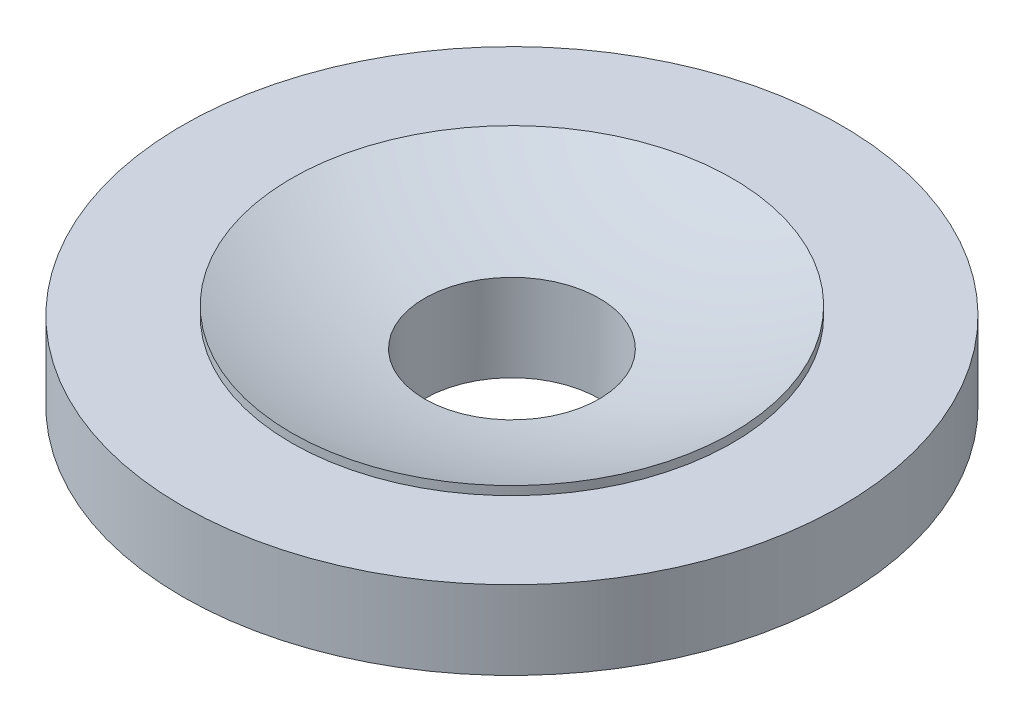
ISO-10303-21;
HEADER;
FILE_DESCRIPTION(('STEP AP214'),'2;1');
FILE_NAME('part.step','',(''),(''),'','','');
FILE_SCHEMA(('AUTOMOTIVE_DESIGN { 1 0 10303 214 1 1 1 1 }'));
ENDSEC;
DATA;
#1=APPLICATION_CONTEXT('core data for automotive mechanical design processes');
#2=APPLICATION_PROTOCOL_DEFINITION('international standard','automotive_design',2000,#1);
#3=PRODUCT_CONTEXT('',#1,'mechanical');
#4=PRODUCT('Part','Part','',(#3));
#5=PRODUCT_RELATED_PRODUCT_CATEGORY('part','',(#4));
#6=PRODUCT_DEFINITION_FORMATION('','',#4);
#7=PRODUCT_DEFINITION_CONTEXT('part definition',#1,'design');
#8=PRODUCT_DEFINITION('design','',#6,#7);
#9=PRODUCT_DEFINITION_SHAPE('','',#8);
#10=(LENGTH_UNIT() NAMED_UNIT(*) SI_UNIT(.MILLI.,.METRE.));
#11=(NAMED_UNIT(*) PLANE_ANGLE_UNIT() SI_UNIT($,.RADIAN.));
#12=(NAMED_UNIT(*) SI_UNIT($,.STERADIAN.) SOLID_ANGLE_UNIT());
#13=UNCERTAINTY_MEASURE_WITH_UNIT(LENGTH_MEASURE(1.E-05),#10,'distance_accuracy_value','');
#14=(GEOMETRIC_REPRESENTATION_CONTEXT(3) GLOBAL_UNCERTAINTY_ASSIGNED_CONTEXT((#13)) GLOBAL_UNIT_ASSIGNED_CONTEXT((#10,
#11,#12)) REPRESENTATION_CONTEXT('',''));
#15=CARTESIAN_POINT('',(0.,0.,0.));
#16=DIRECTION('',(0.,0.,1.));
#17=DIRECTION('',(1.,0.,0.));
#18=AXIS2_PLACEMENT_3D('',#15,#16,#17);
#19=CARTESIAN_POINT('',(0.,239.998094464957,0.));
#20=DIRECTION('',(0.,1.,0.));
#21=DIRECTION('',(0.,0.,1.));
#22=AXIS2_PLACEMENT_3D('',#19,#20,#21);
#23=DEGENERATE_TOROIDAL_SURFACE('',#22,0.995426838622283,260.,.T.);
#24=CARTESIAN_POINT('',(0.,-17.0595708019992,0.));
#25=DIRECTION('',(0.,1.,0.));
#26=DIRECTION('',(0.,0.,1.));
#27=AXIS2_PLACEMENT_3D('',#24,#25,#26);
#28=CIRCLE('',#27,40.);
#29=CARTESIAN_POINT('',(0.,-17.0595708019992,40.));
#30=VERTEX_POINT('',#29);
#31=EDGE_CURVE('E57',#30,#30,#28,.T.);
#32=ORIENTED_EDGE('',*,*,#31,.F.);
#33=EDGE_LOOP('',(#32));
#34=FACE_BOUND('',#33,.T.);
#35=CARTESIAN_POINT('',(0.,0.,0.));
#36=DIRECTION('',(0.,1.,0.));
#37=DIRECTION('',(0.,0.,1.));
#38=AXIS2_PLACEMENT_3D('',#35,#36,#37);
#39=CIRCLE('',#38,101.);
#40=CARTESIAN_POINT('',(0.,0.,101.));
#41=VERTEX_POINT('',#40);
#42=EDGE_CURVE('E10',#41,#41,#39,.T.);
#43=ORIENTED_EDGE('',*,*,#42,.T.);
#44=EDGE_LOOP('',(#43));
#45=FACE_BOUND('',#44,.T.);
#46=ADVANCED_FACE('F35',(#34,#45),#23,.F.);
#47=CARTESIAN_POINT('',(0.,0.,0.));
#48=DIRECTION('',(0.,1.,0.));
#49=DIRECTION('',(0.,0.,1.));
#50=AXIS2_PLACEMENT_3D('',#47,#48,#49);
#51=CYLINDRICAL_SURFACE('',#50,101.);
#52=CARTESIAN_POINT('',(0.,-4.,0.));
#53=DIRECTION('',(0.,1.,0.));
#54=DIRECTION('',(0.,0.,1.));
#55=AXIS2_PLACEMENT_3D('',#52,#53,#54);
#56=CIRCLE('',#55,101.);
#57=CARTESIAN_POINT('',(0.,-4.,101.));
#58=VERTEX_POINT('',#57);
#59=EDGE_CURVE('E42',#58,#58,#56,.T.);
#60=ORIENTED_EDGE('',*,*,#59,.T.);
#61=EDGE_LOOP('',(#60));
#62=FACE_BOUND('',#61,.T.);
#63=ORIENTED_EDGE('',*,*,#42,.F.);
#64=EDGE_LOOP('',(#63));
#65=FACE_BOUND('',#64,.T.);
#66=ADVANCED_FACE('F87',(#62,#65),#51,.T.);
#67=CARTESIAN_POINT('',(-101.,-4.,0.));
#68=DIRECTION('',(0.,1.,0.));
#69=DIRECTION('',(0.,0.,1.));
#70=AXIS2_PLACEMENT_3D('',#67,#68,#69);
#71=PLANE('',#70);
#72=CARTESIAN_POINT('',(0.,-4.00000000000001,0.));
#73=DIRECTION('',(0.,1.,0.));
#74=DIRECTION('',(0.,0.,1.));
#75=AXIS2_PLACEMENT_3D('',#72,#73,#74);
#76=CIRCLE('',#75,151.);
#77=CARTESIAN_POINT('',(0.,-4.00000000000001,151.));
#78=VERTEX_POINT('',#77);
#79=EDGE_CURVE('E46',#78,#78,#76,.T.);
#80=ORIENTED_EDGE('',*,*,#79,.T.);
#81=EDGE_LOOP('',(#80));
#82=FACE_BOUND('',#81,.T.);
#83=ORIENTED_EDGE('',*,*,#59,.F.);
#84=EDGE_LOOP('',(#83));
#85=FACE_BOUND('',#84,.T.);
#86=ADVANCED_FACE('F81',(#82,#85),#71,.T.);
#87=CARTESIAN_POINT('',(0.,0.,0.));
#88=DIRECTION('',(0.,1.,0.));
#89=DIRECTION('',(0.,0.,1.));
#90=AXIS2_PLACEMENT_3D('',#87,#88,#89);
#91=CYLINDRICAL_SURFACE('',#90,151.);
#92=CARTESIAN_POINT('',(0.,-39.9881963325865,0.));
#93=DIRECTION('',(0.,1.,0.));
#94=DIRECTION('',(0.,0.,1.));
#95=AXIS2_PLACEMENT_3D('',#92,#93,#94);
#96=CIRCLE('',#95,151.);
#97=CARTESIAN_POINT('',(0.,-39.9881963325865,151.));
#98=VERTEX_POINT('',#97);
#99=EDGE_CURVE('E51',#98,#98,#96,.T.);
#100=ORIENTED_EDGE('',*,*,#99,.T.);
#101=EDGE_LOOP('',(#100));
#102=FACE_BOUND('',#101,.T.);
#103=ORIENTED_EDGE('',*,*,#79,.F.);
#104=EDGE_LOOP('',(#103));
#105=FACE_BOUND('',#104,.T.);
#106=ADVANCED_FACE('F75',(#102,#105),#91,.T.);
#107=CARTESIAN_POINT('',(-100.028324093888,-39.9881963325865,0.));
#108=DIRECTION('',(0.,-1.,0.));
#109=DIRECTION('',(0.,0.,-1.));
#110=AXIS2_PLACEMENT_3D('',#107,#108,#109);
#111=PLANE('',#110);
#112=CARTESIAN_POINT('',(0.,-39.9881963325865,0.));
#113=DIRECTION('',(0.,1.,0.));
#114=DIRECTION('',(0.,0.,1.));
#115=AXIS2_PLACEMENT_3D('',#112,#113,#114);
#116=CIRCLE('',#115,100.028324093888);
#117=CARTESIAN_POINT('',(-100.028324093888,-39.9881963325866,0.));
#118=VERTEX_POINT('',#117);
#119=EDGE_CURVE('E54',#118,#118,#116,.T.);
#120=ORIENTED_EDGE('',*,*,#119,.T.);
#121=EDGE_LOOP('',(#120));
#122=FACE_BOUND('',#121,.T.);
#123=ORIENTED_EDGE('',*,*,#99,.F.);
#124=EDGE_LOOP('',(#123));
#125=FACE_BOUND('',#124,.T.);
#126=ADVANCED_FACE('F69',(#122,#125),#111,.T.);
#127=CARTESIAN_POINT('',(0.,200.,0.));
#128=DIRECTION('',(0.,1.,0.));
#129=DIRECTION('',(-1.,0.,0.));
#130=AXIS2_PLACEMENT_3D('',#127,#128,#129);
#131=SPHERICAL_SURFACE('',#130,260.);
#132=CARTESIAN_POINT('',(0.,-56.9046515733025,0.));
#133=DIRECTION('',(0.,1.,0.));
#134=DIRECTION('',(0.,0.,1.));
#135=AXIS2_PLACEMENT_3D('',#132,#133,#134);
#136=CIRCLE('',#135,40.);
#137=CARTESIAN_POINT('',(-40.,-56.9046515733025,0.));
#138=VERTEX_POINT('',#137);
#139=EDGE_CURVE('E38',#138,#138,#136,.F.);
#140=CARTESIAN_POINT('',(-40.,-56.9046515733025,0.));
#141=CARTESIAN_POINT('',(-40.6434646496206,-56.8044643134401,0.));
#142=CARTESIAN_POINT('',(-41.2865528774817,-56.70185944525,0.));
#143=CARTESIAN_POINT('',(-42.5719402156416,-56.4918205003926,0.));
#144=CARTESIAN_POINT('',(-43.2142393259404,-56.3843864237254,0.));
#145=CARTESIAN_POINT('',(-44.4980121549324,-56.1646950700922,0.));
#146=CARTESIAN_POINT('',(-45.1394858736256,-56.0524377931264,0.));
#147=CARTESIAN_POINT('',(-46.4215717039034,-55.8231063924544,0.));
#148=CARTESIAN_POINT('',(-47.062183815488,-55.7060322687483,0.));
#149=CARTESIAN_POINT('',(-48.3425102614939,-55.4670737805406,0.));
#150=CARTESIAN_POINT('',(-48.9822245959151,-55.3451894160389,0.));
#151=CARTESIAN_POINT('',(-50.2607193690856,-55.0966173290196,0.));
#152=CARTESIAN_POINT('',(-50.8994998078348,-54.9699296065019,0.));
#153=CARTESIAN_POINT('',(-52.1760907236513,-54.7117579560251,0.));
#154=CARTESIAN_POINT('',(-52.8139012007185,-54.580274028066,0.));
#155=CARTESIAN_POINT('',(-54.0885161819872,-54.3125173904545,0.));
#156=CARTESIAN_POINT('',(-54.7253206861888,-54.1762446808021,0.));
#157=CARTESIAN_POINT('',(-55.9978877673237,-53.8989181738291,0.));
#158=CARTESIAN_POINT('',(-56.6336503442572,-53.7578643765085,0.));
#159=CARTESIAN_POINT('',(-57.904097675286,-53.4709836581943,0.));
#160=CARTESIAN_POINT('',(-58.5387824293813,-53.3251567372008,0.));
#161=CARTESIAN_POINT('',(-59.8070382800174,-53.0287380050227,0.));
#162=CARTESIAN_POINT('',(-60.440609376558,-52.8781461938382,0.));
#163=CARTESIAN_POINT('',(-61.7066021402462,-52.5722061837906,0.));
#164=CARTESIAN_POINT('',(-62.3390238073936,-52.4168579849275,0.));
#165=CARTESIAN_POINT('',(-63.6026820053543,-52.1014139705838,0.));
#166=CARTESIAN_POINT('',(-64.2339185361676,-51.9413181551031,0.));
#167=CARTESIAN_POINT('',(-65.4951708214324,-51.6163879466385,0.));
#168=CARTESIAN_POINT('',(-66.125186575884,-51.4515535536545,0.));
#169=CARTESIAN_POINT('',(-67.3839617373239,-51.1171554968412,0.));
#170=CARTESIAN_POINT('',(-68.0127211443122,-50.9475918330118,0.));
#171=CARTESIAN_POINT('',(-69.2689481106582,-50.6037448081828,0.));
#172=CARTESIAN_POINT('',(-69.8964156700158,-50.4294614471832,0.));
#173=CARTESIAN_POINT('',(-71.1500235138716,-50.0761848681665,0.));
#174=CARTESIAN_POINT('',(-71.7761637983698,-49.8971916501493,0.));
#175=CARTESIAN_POINT('',(-73.0270817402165,-49.5345054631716,0.));
#176=CARTESIAN_POINT('',(-73.6518593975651,-49.350812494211,0.));
#177=CARTESIAN_POINT('',(-74.9000168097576,-48.9787371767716,0.));
#178=CARTESIAN_POINT('',(-75.5233965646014,-48.7903548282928,0.));
#179=CARTESIAN_POINT('',(-76.7687229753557,-48.4089113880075,0.));
#180=CARTESIAN_POINT('',(-77.390669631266,-48.2158502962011,0.));
#181=CARTESIAN_POINT('',(-78.6330947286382,-47.8250602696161,0.));
#182=CARTESIAN_POINT('',(-79.2535731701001,-47.6273313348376,0.));
#183=CARTESIAN_POINT('',(-80.4930268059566,-47.2272167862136,0.));
#184=CARTESIAN_POINT('',(-81.1120020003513,-47.024831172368,0.));
#185=CARTESIAN_POINT('',(-82.348414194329,-46.6154146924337,0.));
#186=CARTESIAN_POINT('',(-82.965851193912,-46.408383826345,0.));
#187=CARTESIAN_POINT('',(-84.19915213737,-45.9896885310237,0.));
#188=CARTESIAN_POINT('',(-84.8150160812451,-45.7780241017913,0.));
#189=CARTESIAN_POINT('',(-86.0451361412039,-45.3500736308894,0.));
#190=CARTESIAN_POINT('',(-86.6593922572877,-45.13378758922,0.));
#191=CARTESIAN_POINT('',(-87.8862619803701,-44.6966061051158,0.));
#192=CARTESIAN_POINT('',(-88.4988755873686,-44.4757106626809,0.));
#193=CARTESIAN_POINT('',(-89.7224257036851,-44.0293228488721,0.));
#194=CARTESIAN_POINT('',(-90.333362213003,-43.8038304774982,0.));
#195=CARTESIAN_POINT('',(-91.5535236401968,-43.3482615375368,0.));
#196=CARTESIAN_POINT('',(-92.1627485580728,-43.1181849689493,0.));
#197=CARTESIAN_POINT('',(-93.3794524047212,-42.6534606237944,0.));
#198=CARTESIAN_POINT('',(-93.9869313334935,-42.4188128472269,0.));
#199=CARTESIAN_POINT('',(-95.2001089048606,-41.9449593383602,0.));
#200=CARTESIAN_POINT('',(-95.8058075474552,-41.7057536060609,0.));
#201=CARTESIAN_POINT('',(-97.0153903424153,-41.222797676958,0.));
#202=CARTESIAN_POINT('',(-97.6192744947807,-40.9790474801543,0.));
#203=CARTESIAN_POINT('',(-98.8251942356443,-40.4870164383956,0.));
#204=CARTESIAN_POINT('',(-99.4272298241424,-40.2387355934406,0.));
#205=CARTESIAN_POINT('',(-100.028324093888,-39.9881963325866,0.));
#206=B_SPLINE_CURVE_WITH_KNOTS('',3,(#140,#141,#142,#143,#144,#145,#146,#147,#148,#149,#150,
#151,#152,#153,#154,#155,#156,#157,#158,#159,#160,#161,#162,#163,#164,#165,#166,#167,#168,#169,
#170,#171,#172,#173,#174,#175,#176,#177,#178,#179,#180,#181,#182,#183,#184,#185,#186,#187,#188,
#189,#190,#191,#192,#193,#194,#195,#196,#197,#198,#199,#200,#201,#202,#203,#204,#205),
.UNSPECIFIED.,.F.,.F.,(4,2,2,2,2,2,2,2,2,2,2,2,2,2,2,2,2,2,2,2,2,2,2,2,2,2,2,2,2,2,2,2,4),(0.,
1.95364792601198,3.90729585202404,5.86094377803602,7.81459170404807,9.76823963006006,
11.7218875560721,13.6755354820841,15.6291834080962,17.5828313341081,19.5364792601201,
21.4901271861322,23.4437751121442,25.3974230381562,27.3510709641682,29.3047188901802,
31.2583668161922,33.2120147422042,35.1656626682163,37.1193105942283,39.0729585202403,
41.0266064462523,42.9802543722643,44.9339022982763,46.8875502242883,48.8411981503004,
50.7948460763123,52.7484940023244,54.7021419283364,56.6557898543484,58.6094377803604,
60.5630857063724,62.5167336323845),.UNSPECIFIED.);
#207=EDGE_CURVE('BSEAM66',#138,#118,#206,.T.);
#208=ORIENTED_EDGE('',*,*,#139,.F.);
#209=ORIENTED_EDGE('',*,*,#119,.F.);
#210=ORIENTED_EDGE('',*,*,#207,.T.);
#211=ORIENTED_EDGE('',*,*,#207,.F.);
#212=EDGE_LOOP('',(#208,#210,#209,#211));
#213=FACE_BOUND('',#212,.T.);
#214=ADVANCED_FACE('F66',(#213),#131,.T.);
#215=CARTESIAN_POINT('',(0.,-60.,0.));
#216=DIRECTION('',(0.,1.,0.));
#217=DIRECTION('',(0.,0.,1.));
#218=AXIS2_PLACEMENT_3D('',#215,#216,#217);
#219=CYLINDRICAL_SURFACE('',#218,40.);
#220=ORIENTED_EDGE('',*,*,#31,.T.);
#221=EDGE_LOOP('',(#220));
#222=FACE_BOUND('',#221,.T.);
#223=ORIENTED_EDGE('',*,*,#139,.T.);
#224=EDGE_LOOP('',(#223));
#225=FACE_BOUND('',#224,.T.);
#226=ADVANCED_FACE('F64',(#222,#225),#219,.F.);
#227=CLOSED_SHELL('',(#46,#66,#86,#106,#126,#214,#226));
#228=MANIFOLD_SOLID_BREP('B2',#227);
#229=ADVANCED_BREP_SHAPE_REPRESENTATION('',(#18,#228),#14);
#230=SHAPE_DEFINITION_REPRESENTATION(#9,#229);
ENDSEC;
END-ISO-10303-21;
